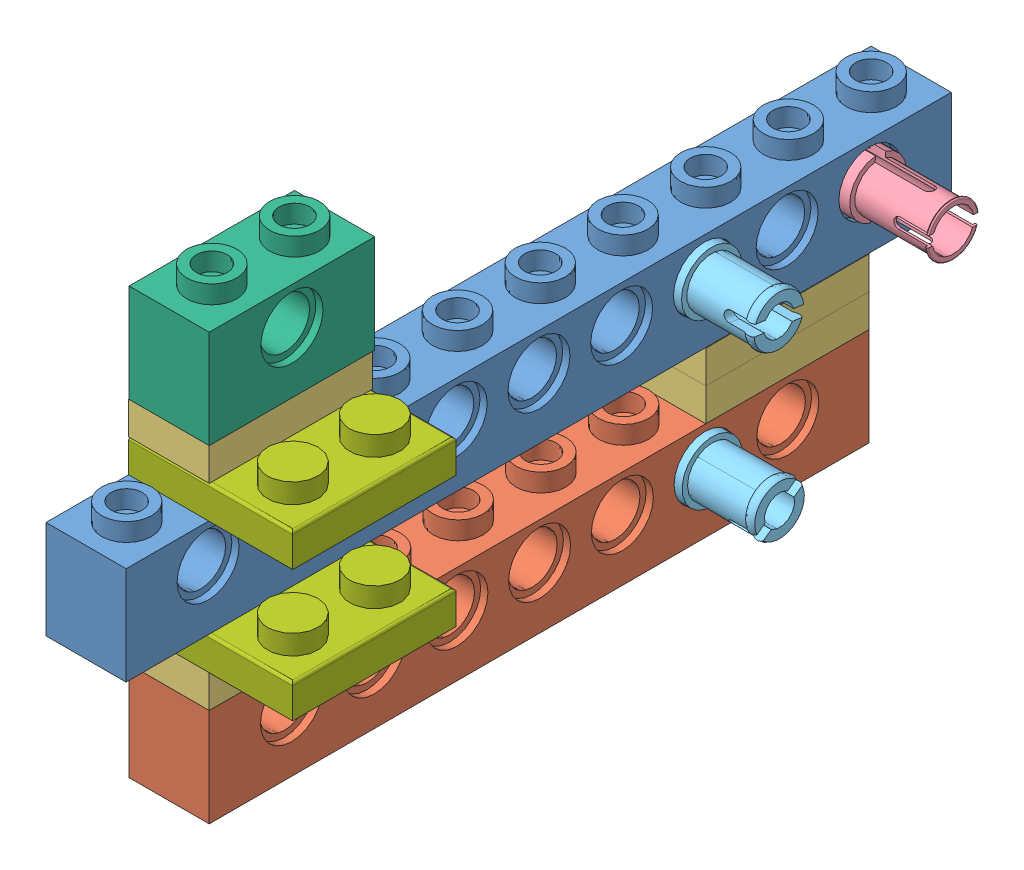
SolidWorks assembly Assem105L.SLDASM, configuration Default (file format 4400). Lengths in mm.
Overall size (16.08 42.93 79.8).
12 component instances, 7 part files, 33 mates.
Components (placement in the parent):
- BASIS TECHNIEK 10 HZwart-1: BASIS TECHNIEK 10 HZwart.SLDPRT [Default] at origin size (7.75 11.25 79.8)
- BASIS TECHNIEK 8 HZwart-1: BASIS TECHNIEK 8 HZwart.SLDPRT [Default] at (0.05 -15.841 7.985) size (7.75 11.25 63.83)
- Part0L2Zwart-1: Part0L2Zwart.SLDPRT [Default] at (-3.875 -11.091 71.815) size (7.8 4.87 15.8)
- Part0L2Zwart-2: Part0L2Zwart.SLDPRT [Default] at (-3.875 -7.925 23.785) size (7.8 4.87 15.8)
- Part0L2Zwart-3: Part0L2Zwart.SLDPRT [Default] at (-3.875 7.925 71.815) size (7.8 4.87 15.8)
- Part0L2Zwart-4: Part0L2Zwart.SLDPRT [Default] at (-3.875 -11.091 23.785) size (7.8 4.87 15.8)
- Open Pin Zwart-1: Open Pin Zwart.SLDPRT [Défaut] at (-4.075 3.6395 7.6465) x (1 0 0) z (0 -0.995816 0.091383) size (16.01 5.5 5.41)
- Pin Glashelder-1: Pin Glashelder.sldprt [Default] at (4.575 1.15 23.875) x (1 0 0) z (0 -0.990417 0.138109) size (14.4 5.84 5.84)
- Pin Glashelder-2: Pin Glashelder.sldprt [Default] at (4.625 -14.691 23.86) x (1 0 0) z (0 0.80666 0.591015) size (14.4 5.84 5.84)
- BASIS TECHNIEK 2 HZwart-1: BASIS TECHNIEK 2 HZwart.SLDPRT [Default] at (0.05 15.841 55.815) size (7.75 11.25 16)
- 2x2LZwart-6: 2x2LZwart.sldprt [2x2 single] at (4.0625 4.75 63.915) size (15.88 5.08 15.8)
- 2x2LZwart-7: 2x2LZwart.sldprt [2x2 single] at (4.0625 -7.925 63.915) size (15.88 5.08 15.8)
Mates (geometry in assembly coordinates):
- Coincident2: coincident aligned: plane of BASIS TECHNIEK 8 HZwart-1 through (-3.825 -11.091 71.815) normal (0 0 1); plane of Part0L2Zwart-1 through (-3.875 -7.925 71.815) normal (0 0 1)
- Coincident3: coincident aligned: plane of BASIS TECHNIEK 8 HZwart-1 through (3.925 -20.591 71.815) normal (1 0 0); plane of Part0L2Zwart-1 through (3.925 -7.925 71.815) normal (1 0 0)
- Coincident4: coincident aligned: plane of BASIS TECHNIEK 8 HZwart-1 through (3.925 -20.591 71.815) normal (1 0 0); plane of Part0L2Zwart-4 through (3.925 -7.925 23.785) normal (1 0 0)
- Coincident5: coincident aligned: plane of BASIS TECHNIEK 8 HZwart-1 through (-3.825 -11.091 7.985) normal (0 0 -1); plane of Part0L2Zwart-4 through (-3.875 -7.925 7.985) normal (0 0 -1)
- Coincident6: coincident anti-aligned: plane of BASIS TECHNIEK 8 HZwart-1 through (3.925 -11.091 71.815) normal (0 1 0); plane of Part0L2Zwart-4 through (-3.875 -11.091 7.985) normal (0 -1 0)
- Coincident7: coincident anti-aligned: plane of BASIS TECHNIEK 8 HZwart-1 through (3.925 -11.091 71.815) normal (0 1 0); plane of Part0L2Zwart-1 through (-3.875 -11.091 56.015) normal (0 -1 0)
- Coincident8: coincident aligned: plane of Part0L2Zwart-2 through (-3.875 -4.759 7.985) normal (0 0 -1); plane of Part0L2Zwart-4 through (-3.875 -7.925 7.985) normal (0 0 -1)
- Coincident9: coincident aligned: plane of Part0L2Zwart-2 through (3.925 -4.759 23.785) normal (1 0 0); plane of Part0L2Zwart-4 through (3.925 -7.925 23.785) normal (1 0 0)
- Coincident10: coincident anti-aligned: plane of Part0L2Zwart-2 through (-3.875 -7.925 7.985) normal (0 -1 0); plane of Part0L2Zwart-4 through (-3.875 -7.925 7.985) normal (0 1 0)
- Coincident12: coincident aligned: plane of Part0L2Zwart-1 through (-3.875 -7.925 71.815) normal (0 0 1); plane of 2x2LZwart-7 through (12 -4.75 71.815) normal (0 0 1)
- Width1: width: plane of BASIS TECHNIEK 10 HZwart-1 through (-3.875 4.75 79.8) normal (0 0 1); plane of BASIS TECHNIEK 10 HZwart-1 through (-3.875 4.75 0) normal (0 0 -1); plane of BASIS TECHNIEK 8 HZwart-1 through (-3.825 -11.091 7.985) normal (0 0 -1); plane of BASIS TECHNIEK 8 HZwart-1 through (-3.825 -11.091 71.815) normal (0 0 1)
- Coincident16: coincident aligned: plane of 2x2LZwart-6 through (12 7.925 71.815) normal (0 0 1); plane of 2x2LZwart-7 through (12 -4.75 71.815) normal (0 0 1)
- Coincident20: coincident aligned: plane of Part0L2Zwart-3 through (-31.3245 11.091 71.815) normal (0 0 1); plane of 2x2LZwart-6 through (12 7.925 71.815) normal (0 0 1)
- Coincident21: coincident anti-aligned: plane of Part0L2Zwart-3 through (-31.3245 7.925 56.015) normal (0 -1 0); plane of 2x2LZwart-6 through (-3.875 7.925 71.815) normal (0 1 0)
- Coincident22: coincident aligned: plane of Part0L2Zwart-3 through (-31.3245 11.091 71.815) normal (0 0 1); plane of BASIS TECHNIEK 2 HZwart-1 through (-31.2745 20.591 71.815) normal (0 0 1)
- Coincident23: coincident aligned: plane of Part0L2Zwart-3 through (-23.5245 11.091 71.815) normal (1 0 0); plane of BASIS TECHNIEK 2 HZwart-1 through (-23.5245 11.091 71.815) normal (1 0 0)
- Coincident24: coincident anti-aligned: plane of Part0L2Zwart-3 through (-31.3245 11.091 56.015) normal (0 1 0); plane of BASIS TECHNIEK 2 HZwart-1 through (-23.5245 11.091 71.815) normal (0 -1 0)
- Concentric1: concentric: cylinder of BASIS TECHNIEK 10 HZwart-1 through (-3.875 1.15 7.875) axis (1 0 0) radius 2.4; cylinder of Open Pin Zwart-1 through (-35.8033 1.15 7.875) axis (-1 0 0) radius 2.25
- Concentric2: concentric: cylinder of BASIS TECHNIEK 10 HZwart-1 through (-3.875 1.15 23.875) axis (1 0 0) radius 2.4; cylinder of Pin Glashelder-1 through (-34.7854 1.15 23.875) axis (-1 0 0) radius 2.4
- Concentric3: concentric: cylinder of BASIS TECHNIEK 8 HZwart-1 through (3.925 -14.691 23.86) axis (-1 0 0) radius 2.4; cylinder of Pin Glashelder-2 through (-39.0832 -14.691 23.86) axis (-1 0 0) radius 2.4
- Coincident28: coincident aligned: plane of Part0L2Zwart-1 through (-3.875 -7.925 71.815) normal (0 0 1); plane of 2x2LZwart-7 through (12 -4.75 71.815) normal (0 0 1)
- Coincident29: coincident aligned: plane of Part0L2Zwart-1 through (-3.875 -7.925 71.815) normal (-1 0 0); plane of 2x2LZwart-7 through (-3.875 -4.75 56.015) normal (-1 0 0)
- Coincident30: coincident anti-aligned: plane of Part0L2Zwart-1 through (-3.875 -7.925 56.015) normal (0 1 0); plane of 2x2LZwart-7 through (-3.875 -7.925 71.815) normal (0 -1 0)
- Coincident31: coincident aligned: plane of BASIS TECHNIEK 10 HZwart-1 through (-3.875 -4.75 79.8) normal (-1 0 0); plane of Part0L2Zwart-1 through (-3.875 -7.925 71.815) normal (-1 0 0)
- Width2: width: plane of BASIS TECHNIEK 10 HZwart-1 through (-3.875 4.75 79.8) normal (0 0 1); plane of BASIS TECHNIEK 10 HZwart-1 through (-3.875 4.75 0) normal (0 0 -1); plane of BASIS TECHNIEK 8 HZwart-1 through (-3.825 -11.091 7.985) normal (0 0 -1); plane of BASIS TECHNIEK 8 HZwart-1 through (-3.825 -11.091 71.815) normal (0 0 1)
- Coincident34: coincident aligned: plane of BASIS TECHNIEK 10 HZwart-1 through (-3.875 -4.75 79.8) normal (-1 0 0); plane of 2x2LZwart-6 through (-3.875 7.925 56.015) normal (-1 0 0)
- Coincident35: coincident aligned: plane of 2x2LZwart-6 through (12 7.925 71.815) normal (0 0 1); plane of 2x2LZwart-7 through (12 -4.75 71.815) normal (0 0 1)
- Coincident36: coincident anti-aligned: plane of BASIS TECHNIEK 10 HZwart-1 through (3.875 4.75 79.8) normal (0 1 0); plane of 2x2LZwart-6 through (-3.875 4.75 71.815) normal (0 -1 0)
- Coincident37: coincident aligned: plane of Part0L2Zwart-3 through (-3.875 11.091 71.815) normal (-1 0 0); plane of 2x2LZwart-6 through (-3.875 7.925 56.015) normal (-1 0 0)
- Concentric4: concentric: cylinder of BASIS TECHNIEK 10 HZwart-1 through (-3.875 1.15 7.875) axis (1 0 0) radius 2.4; cylinder of Open Pin Zwart-1 through (-4.7213 1.15 7.875) axis (-1 0 0) radius 2.25
- Coincident38: coincident anti-aligned: plane of BASIS TECHNIEK 10 HZwart-1 through (3.175 1.15 7.875) normal (1 0 0); plane of Open Pin Zwart-1 through (3.175 3.3906 7.6694) normal (-1 0 0)
- Coincident39: coincident anti-aligned: plane of BASIS TECHNIEK 10 HZwart-1 through (3.175 1.15 23.875) normal (1 0 0); plane of Pin Glashelder-1 through (3.175 1.15 23.875) normal (-1 0 0)
- Coincident40: coincident anti-aligned: plane of BASIS TECHNIEK 8 HZwart-1 through (3.225 -14.691 23.86) normal (1 0 0); plane of Pin Glashelder-2 through (3.225 -14.691 23.86) normal (-1 0 0)
